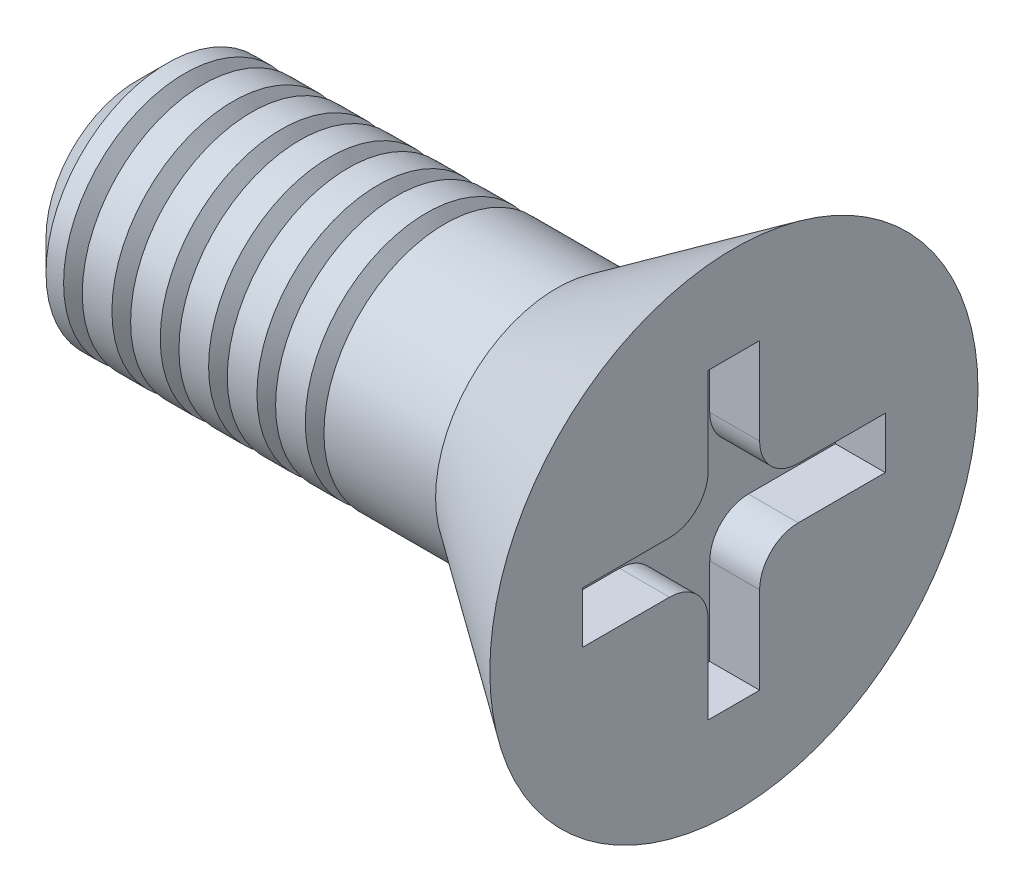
ISO-10303-21;
HEADER;
FILE_DESCRIPTION(('STEP AP214'),'2;1');
FILE_NAME('part.step','',(''),(''),'','','');
FILE_SCHEMA(('AUTOMOTIVE_DESIGN { 1 0 10303 214 1 1 1 1 }'));
ENDSEC;
DATA;
#1=APPLICATION_CONTEXT('core data for automotive mechanical design processes');
#2=APPLICATION_PROTOCOL_DEFINITION('international standard','automotive_design',2000,#1);
#3=PRODUCT_CONTEXT('',#1,'mechanical');
#4=PRODUCT('Part','Part','',(#3));
#5=PRODUCT_RELATED_PRODUCT_CATEGORY('part','',(#4));
#6=PRODUCT_DEFINITION_FORMATION('','',#4);
#7=PRODUCT_DEFINITION_CONTEXT('part definition',#1,'design');
#8=PRODUCT_DEFINITION('design','',#6,#7);
#9=PRODUCT_DEFINITION_SHAPE('','',#8);
#10=(LENGTH_UNIT() NAMED_UNIT(*) SI_UNIT(.MILLI.,.METRE.));
#11=(NAMED_UNIT(*) PLANE_ANGLE_UNIT() SI_UNIT($,.RADIAN.));
#12=(NAMED_UNIT(*) SI_UNIT($,.STERADIAN.) SOLID_ANGLE_UNIT());
#13=UNCERTAINTY_MEASURE_WITH_UNIT(LENGTH_MEASURE(1.E-05),#10,'distance_accuracy_value','');
#14=(GEOMETRIC_REPRESENTATION_CONTEXT(3) GLOBAL_UNCERTAINTY_ASSIGNED_CONTEXT((#13)) GLOBAL_UNIT_ASSIGNED_CONTEXT((#10,
#11,#12)) REPRESENTATION_CONTEXT('',''));
#15=CARTESIAN_POINT('',(0.,0.,0.));
#16=DIRECTION('',(0.,0.,1.));
#17=DIRECTION('',(1.,0.,0.));
#18=AXIS2_PLACEMENT_3D('',#15,#16,#17);
#19=CARTESIAN_POINT('',(3.175,0.,0.));
#20=DIRECTION('',(1.,0.,0.));
#21=DIRECTION('',(0.,0.,-1.));
#22=AXIS2_PLACEMENT_3D('',#19,#20,#21);
#23=CYLINDRICAL_SURFACE('',#22,1.59004000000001);
#24=CARTESIAN_POINT('',(0.84582,0.,0.));
#25=DIRECTION('',(1.,0.,0.));
#26=DIRECTION('',(0.,0.,-1.));
#27=AXIS2_PLACEMENT_3D('',#24,#25,#26);
#28=CIRCLE('',#27,1.59004000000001);
#29=CARTESIAN_POINT('',(0.84582,0.,-1.59004000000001));
#30=VERTEX_POINT('',#29);
#31=EDGE_CURVE('E230',#30,#30,#28,.T.);
#32=ORIENTED_EDGE('',*,*,#31,.F.);
#33=EDGE_LOOP('',(#32));
#34=FACE_BOUND('',#33,.T.);
#35=CARTESIAN_POINT('',(-0.620951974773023,0.,0.));
#36=DIRECTION('',(1.,0.,0.));
#37=DIRECTION('',(0.,0.,-1.));
#38=AXIS2_PLACEMENT_3D('',#35,#36,#37);
#39=CIRCLE('',#38,1.59004000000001);
#40=CARTESIAN_POINT('',(-0.620951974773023,0.,-1.59004000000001));
#41=VERTEX_POINT('',#40);
#42=EDGE_CURVE('E291',#41,#41,#39,.T.);
#43=ORIENTED_EDGE('',*,*,#42,.T.);
#44=EDGE_LOOP('',(#43));
#45=FACE_BOUND('',#44,.T.);
#46=ADVANCED_FACE('F37',(#34,#45),#23,.T.);
#47=CARTESIAN_POINT('',(3.175,0.,0.));
#48=DIRECTION('',(1.,0.,0.));
#49=DIRECTION('',(0.,0.,-1.));
#50=AXIS2_PLACEMENT_3D('',#47,#48,#49);
#51=PLANE('',#50);
#52=DIRECTION('',(0.,-1.,0.));
#53=VECTOR('',#52,1.);
#54=CARTESIAN_POINT('',(3.175,-1.98882,0.33782));
#55=LINE('',#54,#53);
#56=CARTESIAN_POINT('',(3.175,-0.845820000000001,0.33782));
#57=VERTEX_POINT('',#56);
#58=CARTESIAN_POINT('',(3.175,-1.98882,0.33782));
#59=VERTEX_POINT('',#58);
#60=EDGE_CURVE('E213',#57,#59,#55,.T.);
#61=ORIENTED_EDGE('',*,*,#60,.F.);
#62=CARTESIAN_POINT('',(3.175,-0.84582,0.845819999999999));
#63=DIRECTION('',(1.,0.,0.));
#64=DIRECTION('',(0.,0.,-1.));
#65=AXIS2_PLACEMENT_3D('',#62,#63,#64);
#66=CIRCLE('',#65,0.508);
#67=CARTESIAN_POINT('',(3.175,-0.33782,0.845819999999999));
#68=VERTEX_POINT('',#67);
#69=EDGE_CURVE('E265',#57,#68,#66,.T.);
#70=ORIENTED_EDGE('',*,*,#69,.T.);
#71=DIRECTION('',(0.,0.,-1.));
#72=VECTOR('',#71,1.);
#73=CARTESIAN_POINT('',(3.175,-0.33782,0.337819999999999));
#74=LINE('',#73,#72);
#75=CARTESIAN_POINT('',(3.175,-0.33782,1.98882));
#76=VERTEX_POINT('',#75);
#77=EDGE_CURVE('E210',#76,#68,#74,.T.);
#78=ORIENTED_EDGE('',*,*,#77,.F.);
#79=DIRECTION('',(0.,-1.,0.));
#80=VECTOR('',#79,1.);
#81=CARTESIAN_POINT('',(3.175,0.33782,1.98882));
#82=LINE('',#81,#80);
#83=CARTESIAN_POINT('',(3.175,0.33782,1.98882));
#84=VERTEX_POINT('',#83);
#85=EDGE_CURVE('E207',#84,#76,#82,.T.);
#86=ORIENTED_EDGE('',*,*,#85,.F.);
#87=DIRECTION('',(0.,0.,1.));
#88=VECTOR('',#87,1.);
#89=CARTESIAN_POINT('',(3.175,0.33782,0.33782));
#90=LINE('',#89,#88);
#91=CARTESIAN_POINT('',(3.175,0.33782,0.845819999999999));
#92=VERTEX_POINT('',#91);
#93=EDGE_CURVE('E205',#92,#84,#90,.T.);
#94=ORIENTED_EDGE('',*,*,#93,.F.);
#95=CARTESIAN_POINT('',(3.175,0.84582,0.84582));
#96=DIRECTION('',(1.,0.,0.));
#97=DIRECTION('',(0.,0.,-1.));
#98=AXIS2_PLACEMENT_3D('',#95,#96,#97);
#99=CIRCLE('',#98,0.508);
#100=CARTESIAN_POINT('',(3.175,0.84582,0.33782));
#101=VERTEX_POINT('',#100);
#102=EDGE_CURVE('E259',#92,#101,#99,.T.);
#103=ORIENTED_EDGE('',*,*,#102,.T.);
#104=DIRECTION('',(0.,-1.,0.));
#105=VECTOR('',#104,1.);
#106=CARTESIAN_POINT('',(3.175,1.98882,0.337820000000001));
#107=LINE('',#106,#105);
#108=CARTESIAN_POINT('',(3.175,1.98882,0.337820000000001));
#109=VERTEX_POINT('',#108);
#110=EDGE_CURVE('E203',#109,#101,#107,.T.);
#111=ORIENTED_EDGE('',*,*,#110,.F.);
#112=DIRECTION('',(0.,0.,1.));
#113=VECTOR('',#112,1.);
#114=CARTESIAN_POINT('',(3.175,1.98882,-0.337820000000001));
#115=LINE('',#114,#113);
#116=CARTESIAN_POINT('',(3.175,1.98882,-0.337820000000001));
#117=VERTEX_POINT('',#116);
#118=EDGE_CURVE('E158',#117,#109,#115,.T.);
#119=ORIENTED_EDGE('',*,*,#118,.F.);
#120=DIRECTION('',(0.,1.,0.));
#121=VECTOR('',#120,1.);
#122=CARTESIAN_POINT('',(3.175,1.98882,-0.337820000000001));
#123=LINE('',#122,#121);
#124=CARTESIAN_POINT('',(3.175,0.845820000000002,-0.33782));
#125=VERTEX_POINT('',#124);
#126=EDGE_CURVE('E170',#125,#117,#123,.T.);
#127=ORIENTED_EDGE('',*,*,#126,.F.);
#128=CARTESIAN_POINT('',(3.175,0.845820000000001,-0.84582));
#129=DIRECTION('',(1.,0.,0.));
#130=DIRECTION('',(0.,0.,-1.));
#131=AXIS2_PLACEMENT_3D('',#128,#129,#130);
#132=CIRCLE('',#131,0.508);
#133=CARTESIAN_POINT('',(3.175,0.337820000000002,-0.845819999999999));
#134=VERTEX_POINT('',#133);
#135=EDGE_CURVE('E261',#125,#134,#132,.T.);
#136=ORIENTED_EDGE('',*,*,#135,.T.);
#137=DIRECTION('',(0.,0.,1.));
#138=VECTOR('',#137,1.);
#139=CARTESIAN_POINT('',(3.175,0.337820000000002,-0.33782));
#140=LINE('',#139,#138);
#141=CARTESIAN_POINT('',(3.175,0.33782,-1.98882));
#142=VERTEX_POINT('',#141);
#143=EDGE_CURVE('E172',#142,#134,#140,.T.);
#144=ORIENTED_EDGE('',*,*,#143,.F.);
#145=DIRECTION('',(0.,1.,0.));
#146=VECTOR('',#145,1.);
#147=CARTESIAN_POINT('',(3.175,-0.33782,-1.98882));
#148=LINE('',#147,#146);
#149=CARTESIAN_POINT('',(3.175,-0.33782,-1.98882));
#150=VERTEX_POINT('',#149);
#151=EDGE_CURVE('E223',#150,#142,#148,.T.);
#152=ORIENTED_EDGE('',*,*,#151,.F.);
#153=DIRECTION('',(0.,0.,-1.));
#154=VECTOR('',#153,1.);
#155=CARTESIAN_POINT('',(3.175,-0.337820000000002,-0.337819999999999));
#156=LINE('',#155,#154);
#157=CARTESIAN_POINT('',(3.175,-0.337820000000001,-0.845819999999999));
#158=VERTEX_POINT('',#157);
#159=EDGE_CURVE('E221',#158,#150,#156,.T.);
#160=ORIENTED_EDGE('',*,*,#159,.F.);
#161=CARTESIAN_POINT('',(3.175,-0.845820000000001,-0.84582));
#162=DIRECTION('',(1.,0.,0.));
#163=DIRECTION('',(0.,0.,-1.));
#164=AXIS2_PLACEMENT_3D('',#161,#162,#163);
#165=CIRCLE('',#164,0.508);
#166=CARTESIAN_POINT('',(3.175,-0.845820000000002,-0.33782));
#167=VERTEX_POINT('',#166);
#168=EDGE_CURVE('E263',#158,#167,#165,.T.);
#169=ORIENTED_EDGE('',*,*,#168,.T.);
#170=DIRECTION('',(0.,1.,0.));
#171=VECTOR('',#170,1.);
#172=CARTESIAN_POINT('',(3.175,-1.98882,-0.337820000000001));
#173=LINE('',#172,#171);
#174=CARTESIAN_POINT('',(3.175,-1.98882,-0.337820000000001));
#175=VERTEX_POINT('',#174);
#176=EDGE_CURVE('E218',#175,#167,#173,.T.);
#177=ORIENTED_EDGE('',*,*,#176,.F.);
#178=DIRECTION('',(0.,0.,-1.));
#179=VECTOR('',#178,1.);
#180=CARTESIAN_POINT('',(3.175,-1.98882,0.33782));
#181=LINE('',#180,#179);
#182=EDGE_CURVE('E215',#59,#175,#181,.T.);
#183=ORIENTED_EDGE('',*,*,#182,.F.);
#184=EDGE_LOOP('',(#61,#70,#78,#86,#94,#103,#111,#119,#127,#136,#144,#152,#160,#169,#177,#183));
#185=FACE_BOUND('',#184,.T.);
#186=CARTESIAN_POINT('',(3.175,0.,0.));
#187=DIRECTION('',(1.,0.,0.));
#188=DIRECTION('',(0.,0.,-1.));
#189=AXIS2_PLACEMENT_3D('',#186,#187,#188);
#190=CIRCLE('',#189,3.20675000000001);
#191=CARTESIAN_POINT('',(3.175,0.,-3.20675000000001));
#192=VERTEX_POINT('',#191);
#193=EDGE_CURVE('E247',#192,#192,#190,.T.);
#194=ORIENTED_EDGE('',*,*,#193,.T.);
#195=EDGE_LOOP('',(#194));
#196=FACE_BOUND('',#195,.T.);
#197=ADVANCED_FACE('F371',(#185,#196),#51,.T.);
#198=CARTESIAN_POINT('',(3.175,0.,0.));
#199=DIRECTION('',(1.,0.,0.));
#200=DIRECTION('',(0.,0.,-1.));
#201=AXIS2_PLACEMENT_3D('',#198,#199,#200);
#202=CONICAL_SURFACE('',#201,3.20675000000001,0.606762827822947);
#203=ORIENTED_EDGE('',*,*,#31,.T.);
#204=EDGE_LOOP('',(#203));
#205=FACE_BOUND('',#204,.T.);
#206=ORIENTED_EDGE('',*,*,#193,.F.);
#207=EDGE_LOOP('',(#206));
#208=FACE_BOUND('',#207,.T.);
#209=ADVANCED_FACE('F377',(#205,#208),#202,.T.);
#210=CARTESIAN_POINT('',(2.51968,1.98882,-0.337820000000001));
#211=DIRECTION('',(0.,1.,0.));
#212=DIRECTION('',(0.,0.,1.));
#213=AXIS2_PLACEMENT_3D('',#210,#211,#212);
#214=PLANE('',#213);
#215=ORIENTED_EDGE('',*,*,#118,.T.);
#216=DIRECTION('',(1.,0.,0.));
#217=VECTOR('',#216,1.);
#218=CARTESIAN_POINT('',(2.51968,1.98882,0.337820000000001));
#219=LINE('',#218,#217);
#220=CARTESIAN_POINT('',(2.51968,1.98882,0.337820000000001));
#221=VERTEX_POINT('',#220);
#222=EDGE_CURVE('E152',#221,#109,#219,.T.);
#223=ORIENTED_EDGE('',*,*,#222,.F.);
#224=DIRECTION('',(0.,0.,1.));
#225=VECTOR('',#224,1.);
#226=CARTESIAN_POINT('',(2.51968,1.98882,-0.337820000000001));
#227=LINE('',#226,#225);
#228=CARTESIAN_POINT('',(2.51968,1.98882,-0.337820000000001));
#229=VERTEX_POINT('',#228);
#230=EDGE_CURVE('E156',#229,#221,#227,.T.);
#231=ORIENTED_EDGE('',*,*,#230,.F.);
#232=DIRECTION('',(1.,0.,0.));
#233=VECTOR('',#232,1.);
#234=CARTESIAN_POINT('',(2.51968,1.98882,-0.337820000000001));
#235=LINE('',#234,#233);
#236=EDGE_CURVE('E228',#229,#117,#235,.T.);
#237=ORIENTED_EDGE('',*,*,#236,.T.);
#238=EDGE_LOOP('',(#215,#223,#231,#237));
#239=FACE_BOUND('',#238,.T.);
#240=ADVANCED_FACE('F153',(#239),#214,.F.);
#241=CARTESIAN_POINT('',(2.51968,1.98882,-0.337820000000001));
#242=DIRECTION('',(0.,0.,-1.));
#243=DIRECTION('',(0.,1.,0.));
#244=AXIS2_PLACEMENT_3D('',#241,#242,#243);
#245=PLANE('',#244);
#246=DIRECTION('',(0.,1.,0.));
#247=VECTOR('',#246,1.);
#248=CARTESIAN_POINT('',(2.51968,1.98882,-0.337820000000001));
#249=LINE('',#248,#247);
#250=CARTESIAN_POINT('',(2.51968,0.845820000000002,-0.33782));
#251=VERTEX_POINT('',#250);
#252=EDGE_CURVE('E161',#251,#229,#249,.T.);
#253=ORIENTED_EDGE('',*,*,#252,.F.);
#254=DIRECTION('',(1.,0.,0.));
#255=VECTOR('',#254,1.);
#256=CARTESIAN_POINT('',(2.51968,0.845820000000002,-0.33782));
#257=LINE('',#256,#255);
#258=EDGE_CURVE('E274',#251,#125,#257,.T.);
#259=ORIENTED_EDGE('',*,*,#258,.T.);
#260=ORIENTED_EDGE('',*,*,#126,.T.);
#261=ORIENTED_EDGE('',*,*,#236,.F.);
#262=EDGE_LOOP('',(#253,#259,#260,#261));
#263=FACE_BOUND('',#262,.T.);
#264=ADVANCED_FACE('F471',(#263),#245,.F.);
#265=CARTESIAN_POINT('',(2.51968,0.337820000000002,-0.33782));
#266=DIRECTION('',(0.,1.,0.));
#267=DIRECTION('',(0.,0.,1.));
#268=AXIS2_PLACEMENT_3D('',#265,#266,#267);
#269=PLANE('',#268);
#270=ORIENTED_EDGE('',*,*,#143,.T.);
#271=DIRECTION('',(1.,0.,0.));
#272=VECTOR('',#271,1.);
#273=CARTESIAN_POINT('',(2.51968,0.337820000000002,-0.845819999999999));
#274=LINE('',#273,#272);
#275=CARTESIAN_POINT('',(2.51968,0.337820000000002,-0.845819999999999));
#276=VERTEX_POINT('',#275);
#277=EDGE_CURVE('E277',#134,#276,#274,.F.);
#278=ORIENTED_EDGE('',*,*,#277,.T.);
#279=DIRECTION('',(0.,0.,1.));
#280=VECTOR('',#279,1.);
#281=CARTESIAN_POINT('',(2.51968,0.337820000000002,-0.33782));
#282=LINE('',#281,#280);
#283=CARTESIAN_POINT('',(2.51968,0.33782,-1.98882));
#284=VERTEX_POINT('',#283);
#285=EDGE_CURVE('E198',#284,#276,#282,.T.);
#286=ORIENTED_EDGE('',*,*,#285,.F.);
#287=DIRECTION('',(1.,0.,0.));
#288=VECTOR('',#287,1.);
#289=CARTESIAN_POINT('',(2.51968,0.33782,-1.98882));
#290=LINE('',#289,#288);
#291=EDGE_CURVE('E231',#284,#142,#290,.T.);
#292=ORIENTED_EDGE('',*,*,#291,.T.);
#293=EDGE_LOOP('',(#270,#278,#286,#292));
#294=FACE_BOUND('',#293,.T.);
#295=ADVANCED_FACE('F505',(#294),#269,.F.);
#296=CARTESIAN_POINT('',(2.51968,-0.33782,-1.98882));
#297=DIRECTION('',(0.,0.,-1.));
#298=DIRECTION('',(-1.,0.,0.));
#299=AXIS2_PLACEMENT_3D('',#296,#297,#298);
#300=PLANE('',#299);
#301=ORIENTED_EDGE('',*,*,#151,.T.);
#302=ORIENTED_EDGE('',*,*,#291,.F.);
#303=DIRECTION('',(0.,1.,0.));
#304=VECTOR('',#303,1.);
#305=CARTESIAN_POINT('',(2.51968,-0.33782,-1.98882));
#306=LINE('',#305,#304);
#307=CARTESIAN_POINT('',(2.51968,-0.33782,-1.98882));
#308=VERTEX_POINT('',#307);
#309=EDGE_CURVE('E195',#308,#284,#306,.T.);
#310=ORIENTED_EDGE('',*,*,#309,.F.);
#311=DIRECTION('',(1.,0.,0.));
#312=VECTOR('',#311,1.);
#313=CARTESIAN_POINT('',(2.51968,-0.33782,-1.98882));
#314=LINE('',#313,#312);
#315=EDGE_CURVE('E233',#308,#150,#314,.T.);
#316=ORIENTED_EDGE('',*,*,#315,.T.);
#317=EDGE_LOOP('',(#301,#302,#310,#316));
#318=FACE_BOUND('',#317,.T.);
#319=ADVANCED_FACE('F501',(#318),#300,.F.);
#320=CARTESIAN_POINT('',(2.51968,-0.337820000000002,-0.337819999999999));
#321=DIRECTION('',(0.,-1.,0.));
#322=DIRECTION('',(0.,0.,-1.));
#323=AXIS2_PLACEMENT_3D('',#320,#321,#322);
#324=PLANE('',#323);
#325=DIRECTION('',(0.,0.,-1.));
#326=VECTOR('',#325,1.);
#327=CARTESIAN_POINT('',(2.51968,-0.337820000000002,-0.337819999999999));
#328=LINE('',#327,#326);
#329=CARTESIAN_POINT('',(2.51968,-0.337820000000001,-0.845819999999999));
#330=VERTEX_POINT('',#329);
#331=EDGE_CURVE('E193',#330,#308,#328,.T.);
#332=ORIENTED_EDGE('',*,*,#331,.F.);
#333=DIRECTION('',(1.,0.,0.));
#334=VECTOR('',#333,1.);
#335=CARTESIAN_POINT('',(2.51968,-0.337820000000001,-0.845819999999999));
#336=LINE('',#335,#334);
#337=EDGE_CURVE('E269',#330,#158,#336,.T.);
#338=ORIENTED_EDGE('',*,*,#337,.T.);
#339=ORIENTED_EDGE('',*,*,#159,.T.);
#340=ORIENTED_EDGE('',*,*,#315,.F.);
#341=EDGE_LOOP('',(#332,#338,#339,#340));
#342=FACE_BOUND('',#341,.T.);
#343=ADVANCED_FACE('F497',(#342),#324,.F.);
#344=CARTESIAN_POINT('',(2.51968,-1.98882,-0.337820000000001));
#345=DIRECTION('',(0.,0.,-1.));
#346=DIRECTION('',(0.,1.,0.));
#347=AXIS2_PLACEMENT_3D('',#344,#345,#346);
#348=PLANE('',#347);
#349=ORIENTED_EDGE('',*,*,#176,.T.);
#350=DIRECTION('',(1.,0.,0.));
#351=VECTOR('',#350,1.);
#352=CARTESIAN_POINT('',(2.51968,-0.845820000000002,-0.33782));
#353=LINE('',#352,#351);
#354=CARTESIAN_POINT('',(2.51968,-0.845820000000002,-0.33782));
#355=VERTEX_POINT('',#354);
#356=EDGE_CURVE('E272',#167,#355,#353,.F.);
#357=ORIENTED_EDGE('',*,*,#356,.T.);
#358=DIRECTION('',(0.,1.,0.));
#359=VECTOR('',#358,1.);
#360=CARTESIAN_POINT('',(2.51968,-1.98882,-0.337820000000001));
#361=LINE('',#360,#359);
#362=CARTESIAN_POINT('',(2.51968,-1.98882,-0.337820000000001));
#363=VERTEX_POINT('',#362);
#364=EDGE_CURVE('E190',#363,#355,#361,.T.);
#365=ORIENTED_EDGE('',*,*,#364,.F.);
#366=DIRECTION('',(1.,0.,0.));
#367=VECTOR('',#366,1.);
#368=CARTESIAN_POINT('',(2.51968,-1.98882,-0.337820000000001));
#369=LINE('',#368,#367);
#370=EDGE_CURVE('E236',#363,#175,#369,.T.);
#371=ORIENTED_EDGE('',*,*,#370,.T.);
#372=EDGE_LOOP('',(#349,#357,#365,#371));
#373=FACE_BOUND('',#372,.T.);
#374=ADVANCED_FACE('F493',(#373),#348,.F.);
#375=CARTESIAN_POINT('',(2.51968,-1.98882,0.33782));
#376=DIRECTION('',(0.,-1.,0.));
#377=DIRECTION('',(0.,0.,-1.));
#378=AXIS2_PLACEMENT_3D('',#375,#376,#377);
#379=PLANE('',#378);
#380=ORIENTED_EDGE('',*,*,#182,.T.);
#381=ORIENTED_EDGE('',*,*,#370,.F.);
#382=DIRECTION('',(0.,0.,-1.));
#383=VECTOR('',#382,1.);
#384=CARTESIAN_POINT('',(2.51968,-1.98882,0.33782));
#385=LINE('',#384,#383);
#386=CARTESIAN_POINT('',(2.51968,-1.98882,0.33782));
#387=VERTEX_POINT('',#386);
#388=EDGE_CURVE('E187',#387,#363,#385,.T.);
#389=ORIENTED_EDGE('',*,*,#388,.F.);
#390=DIRECTION('',(1.,0.,0.));
#391=VECTOR('',#390,1.);
#392=CARTESIAN_POINT('',(2.51968,-1.98882,0.33782));
#393=LINE('',#392,#391);
#394=EDGE_CURVE('E238',#387,#59,#393,.T.);
#395=ORIENTED_EDGE('',*,*,#394,.T.);
#396=EDGE_LOOP('',(#380,#381,#389,#395));
#397=FACE_BOUND('',#396,.T.);
#398=ADVANCED_FACE('F489',(#397),#379,.F.);
#399=CARTESIAN_POINT('',(2.51968,-1.98882,0.33782));
#400=DIRECTION('',(0.,0.,1.));
#401=DIRECTION('',(0.,-1.,0.));
#402=AXIS2_PLACEMENT_3D('',#399,#400,#401);
#403=PLANE('',#402);
#404=DIRECTION('',(0.,-1.,0.));
#405=VECTOR('',#404,1.);
#406=CARTESIAN_POINT('',(2.51968,-1.98882,0.33782));
#407=LINE('',#406,#405);
#408=CARTESIAN_POINT('',(2.51968,-0.845820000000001,0.33782));
#409=VERTEX_POINT('',#408);
#410=EDGE_CURVE('E185',#409,#387,#407,.T.);
#411=ORIENTED_EDGE('',*,*,#410,.F.);
#412=DIRECTION('',(1.,0.,0.));
#413=VECTOR('',#412,1.);
#414=CARTESIAN_POINT('',(2.51968,-0.845820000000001,0.33782));
#415=LINE('',#414,#413);
#416=EDGE_CURVE('E256',#409,#57,#415,.T.);
#417=ORIENTED_EDGE('',*,*,#416,.T.);
#418=ORIENTED_EDGE('',*,*,#60,.T.);
#419=ORIENTED_EDGE('',*,*,#394,.F.);
#420=EDGE_LOOP('',(#411,#417,#418,#419));
#421=FACE_BOUND('',#420,.T.);
#422=ADVANCED_FACE('F485',(#421),#403,.F.);
#423=CARTESIAN_POINT('',(2.51968,-0.33782,0.337819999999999));
#424=DIRECTION('',(0.,-1.,0.));
#425=DIRECTION('',(0.,0.,-1.));
#426=AXIS2_PLACEMENT_3D('',#423,#424,#425);
#427=PLANE('',#426);
#428=ORIENTED_EDGE('',*,*,#77,.T.);
#429=DIRECTION('',(1.,0.,0.));
#430=VECTOR('',#429,1.);
#431=CARTESIAN_POINT('',(2.51968,-0.33782,0.845819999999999));
#432=LINE('',#431,#430);
#433=CARTESIAN_POINT('',(2.51968,-0.33782,0.845819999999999));
#434=VERTEX_POINT('',#433);
#435=EDGE_CURVE('E267',#68,#434,#432,.F.);
#436=ORIENTED_EDGE('',*,*,#435,.T.);
#437=DIRECTION('',(0.,0.,-1.));
#438=VECTOR('',#437,1.);
#439=CARTESIAN_POINT('',(2.51968,-0.33782,0.337819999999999));
#440=LINE('',#439,#438);
#441=CARTESIAN_POINT('',(2.51968,-0.33782,1.98882));
#442=VERTEX_POINT('',#441);
#443=EDGE_CURVE('E182',#442,#434,#440,.T.);
#444=ORIENTED_EDGE('',*,*,#443,.F.);
#445=DIRECTION('',(1.,0.,0.));
#446=VECTOR('',#445,1.);
#447=CARTESIAN_POINT('',(2.51968,-0.33782,1.98882));
#448=LINE('',#447,#446);
#449=EDGE_CURVE('E241',#442,#76,#448,.T.);
#450=ORIENTED_EDGE('',*,*,#449,.T.);
#451=EDGE_LOOP('',(#428,#436,#444,#450));
#452=FACE_BOUND('',#451,.T.);
#453=ADVANCED_FACE('F481',(#452),#427,.F.);
#454=CARTESIAN_POINT('',(2.51968,0.33782,1.98882));
#455=DIRECTION('',(0.,0.,1.));
#456=DIRECTION('',(1.,0.,0.));
#457=AXIS2_PLACEMENT_3D('',#454,#455,#456);
#458=PLANE('',#457);
#459=ORIENTED_EDGE('',*,*,#85,.T.);
#460=ORIENTED_EDGE('',*,*,#449,.F.);
#461=DIRECTION('',(0.,-1.,0.));
#462=VECTOR('',#461,1.);
#463=CARTESIAN_POINT('',(2.51968,0.33782,1.98882));
#464=LINE('',#463,#462);
#465=CARTESIAN_POINT('',(2.51968,0.33782,1.98882));
#466=VERTEX_POINT('',#465);
#467=EDGE_CURVE('E179',#466,#442,#464,.T.);
#468=ORIENTED_EDGE('',*,*,#467,.F.);
#469=DIRECTION('',(1.,0.,0.));
#470=VECTOR('',#469,1.);
#471=CARTESIAN_POINT('',(2.51968,0.33782,1.98882));
#472=LINE('',#471,#470);
#473=EDGE_CURVE('E160',#466,#84,#472,.T.);
#474=ORIENTED_EDGE('',*,*,#473,.T.);
#475=EDGE_LOOP('',(#459,#460,#468,#474));
#476=FACE_BOUND('',#475,.T.);
#477=ADVANCED_FACE('F477',(#476),#458,.F.);
#478=CARTESIAN_POINT('',(2.51968,0.33782,0.33782));
#479=DIRECTION('',(0.,1.,0.));
#480=DIRECTION('',(0.,0.,1.));
#481=AXIS2_PLACEMENT_3D('',#478,#479,#480);
#482=PLANE('',#481);
#483=DIRECTION('',(0.,0.,1.));
#484=VECTOR('',#483,1.);
#485=CARTESIAN_POINT('',(2.51968,0.33782,0.33782));
#486=LINE('',#485,#484);
#487=CARTESIAN_POINT('',(2.51968,0.33782,0.845819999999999));
#488=VERTEX_POINT('',#487);
#489=EDGE_CURVE('E165',#488,#466,#486,.T.);
#490=ORIENTED_EDGE('',*,*,#489,.F.);
#491=DIRECTION('',(1.,0.,0.));
#492=VECTOR('',#491,1.);
#493=CARTESIAN_POINT('',(2.51968,0.33782,0.845819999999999));
#494=LINE('',#493,#492);
#495=EDGE_CURVE('E279',#488,#92,#494,.T.);
#496=ORIENTED_EDGE('',*,*,#495,.T.);
#497=ORIENTED_EDGE('',*,*,#93,.T.);
#498=ORIENTED_EDGE('',*,*,#473,.F.);
#499=EDGE_LOOP('',(#490,#496,#497,#498));
#500=FACE_BOUND('',#499,.T.);
#501=ADVANCED_FACE('F474',(#500),#482,.F.);
#502=CARTESIAN_POINT('',(2.51968,1.98882,0.337820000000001));
#503=DIRECTION('',(0.,0.,1.));
#504=DIRECTION('',(0.,-1.,0.));
#505=AXIS2_PLACEMENT_3D('',#502,#503,#504);
#506=PLANE('',#505);
#507=ORIENTED_EDGE('',*,*,#110,.T.);
#508=DIRECTION('',(1.,0.,0.));
#509=VECTOR('',#508,1.);
#510=CARTESIAN_POINT('',(2.51968,0.84582,0.33782));
#511=LINE('',#510,#509);
#512=CARTESIAN_POINT('',(2.51968,0.84582,0.33782));
#513=VERTEX_POINT('',#512);
#514=EDGE_CURVE('E54',#101,#513,#511,.F.);
#515=ORIENTED_EDGE('',*,*,#514,.T.);
#516=DIRECTION('',(0.,-1.,0.));
#517=VECTOR('',#516,1.);
#518=CARTESIAN_POINT('',(2.51968,1.98882,0.337820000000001));
#519=LINE('',#518,#517);
#520=EDGE_CURVE('E163',#221,#513,#519,.T.);
#521=ORIENTED_EDGE('',*,*,#520,.F.);
#522=ORIENTED_EDGE('',*,*,#222,.T.);
#523=EDGE_LOOP('',(#507,#515,#521,#522));
#524=FACE_BOUND('',#523,.T.);
#525=ADVANCED_FACE('F164',(#524),#506,.F.);
#526=CARTESIAN_POINT('',(2.51968,0.,0.));
#527=DIRECTION('',(1.,0.,0.));
#528=DIRECTION('',(0.,0.,-1.));
#529=AXIS2_PLACEMENT_3D('',#526,#527,#528);
#530=PLANE('',#529);
#531=ORIENTED_EDGE('',*,*,#230,.T.);
#532=ORIENTED_EDGE('',*,*,#520,.T.);
#533=CARTESIAN_POINT('',(2.51968,0.84582,0.84582));
#534=DIRECTION('',(1.,0.,0.));
#535=DIRECTION('',(0.,0.,-1.));
#536=AXIS2_PLACEMENT_3D('',#533,#534,#535);
#537=CIRCLE('',#536,0.508);
#538=EDGE_CURVE('E11',#513,#488,#537,.F.);
#539=ORIENTED_EDGE('',*,*,#538,.T.);
#540=ORIENTED_EDGE('',*,*,#489,.T.);
#541=ORIENTED_EDGE('',*,*,#467,.T.);
#542=ORIENTED_EDGE('',*,*,#443,.T.);
#543=CARTESIAN_POINT('',(2.51968,-0.84582,0.845819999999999));
#544=DIRECTION('',(1.,0.,0.));
#545=DIRECTION('',(0.,0.,-1.));
#546=AXIS2_PLACEMENT_3D('',#543,#544,#545);
#547=CIRCLE('',#546,0.508);
#548=EDGE_CURVE('E283',#434,#409,#547,.F.);
#549=ORIENTED_EDGE('',*,*,#548,.T.);
#550=ORIENTED_EDGE('',*,*,#410,.T.);
#551=ORIENTED_EDGE('',*,*,#388,.T.);
#552=ORIENTED_EDGE('',*,*,#364,.T.);
#553=CARTESIAN_POINT('',(2.51968,-0.845820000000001,-0.84582));
#554=DIRECTION('',(1.,0.,0.));
#555=DIRECTION('',(0.,0.,-1.));
#556=AXIS2_PLACEMENT_3D('',#553,#554,#555);
#557=CIRCLE('',#556,0.508);
#558=EDGE_CURVE('E285',#355,#330,#557,.F.);
#559=ORIENTED_EDGE('',*,*,#558,.T.);
#560=ORIENTED_EDGE('',*,*,#331,.T.);
#561=ORIENTED_EDGE('',*,*,#309,.T.);
#562=ORIENTED_EDGE('',*,*,#285,.T.);
#563=CARTESIAN_POINT('',(2.51968,0.845820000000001,-0.84582));
#564=DIRECTION('',(1.,0.,0.));
#565=DIRECTION('',(0.,0.,-1.));
#566=AXIS2_PLACEMENT_3D('',#563,#564,#565);
#567=CIRCLE('',#566,0.508);
#568=EDGE_CURVE('E46',#276,#251,#567,.F.);
#569=ORIENTED_EDGE('',*,*,#568,.T.);
#570=ORIENTED_EDGE('',*,*,#252,.T.);
#571=EDGE_LOOP('',(#531,#532,#539,#540,#541,#542,#549,#550,#551,#552,#559,#560,#561,#562,#569,#570));
#572=FACE_BOUND('',#571,.T.);
#573=ADVANCED_FACE('F167',(#572),#530,.T.);
#574=CARTESIAN_POINT('',(2.51968,-0.84582,0.845819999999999));
#575=DIRECTION('',(1.,0.,0.));
#576=DIRECTION('',(0.,0.,-1.));
#577=AXIS2_PLACEMENT_3D('',#574,#575,#576);
#578=CYLINDRICAL_SURFACE('',#577,0.508);
#579=ORIENTED_EDGE('',*,*,#548,.F.);
#580=ORIENTED_EDGE('',*,*,#435,.F.);
#581=ORIENTED_EDGE('',*,*,#69,.F.);
#582=ORIENTED_EDGE('',*,*,#416,.F.);
#583=EDGE_LOOP('',(#579,#580,#581,#582));
#584=FACE_BOUND('',#583,.T.);
#585=ADVANCED_FACE('F513',(#584),#578,.T.);
#586=CARTESIAN_POINT('',(2.51968,-0.845820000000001,-0.84582));
#587=DIRECTION('',(1.,0.,0.));
#588=DIRECTION('',(0.,0.,-1.));
#589=AXIS2_PLACEMENT_3D('',#586,#587,#588);
#590=CYLINDRICAL_SURFACE('',#589,0.508);
#591=ORIENTED_EDGE('',*,*,#558,.F.);
#592=ORIENTED_EDGE('',*,*,#356,.F.);
#593=ORIENTED_EDGE('',*,*,#168,.F.);
#594=ORIENTED_EDGE('',*,*,#337,.F.);
#595=EDGE_LOOP('',(#591,#592,#593,#594));
#596=FACE_BOUND('',#595,.T.);
#597=ADVANCED_FACE('F518',(#596),#590,.T.);
#598=CARTESIAN_POINT('',(2.51968,0.845820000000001,-0.84582));
#599=DIRECTION('',(1.,0.,0.));
#600=DIRECTION('',(0.,0.,-1.));
#601=AXIS2_PLACEMENT_3D('',#598,#599,#600);
#602=CYLINDRICAL_SURFACE('',#601,0.508);
#603=ORIENTED_EDGE('',*,*,#568,.F.);
#604=ORIENTED_EDGE('',*,*,#277,.F.);
#605=ORIENTED_EDGE('',*,*,#135,.F.);
#606=ORIENTED_EDGE('',*,*,#258,.F.);
#607=EDGE_LOOP('',(#603,#604,#605,#606));
#608=FACE_BOUND('',#607,.T.);
#609=ADVANCED_FACE('F366',(#608),#602,.T.);
#610=CARTESIAN_POINT('',(2.51968,0.84582,0.84582));
#611=DIRECTION('',(1.,0.,0.));
#612=DIRECTION('',(0.,0.,-1.));
#613=AXIS2_PLACEMENT_3D('',#610,#611,#612);
#614=CYLINDRICAL_SURFACE('',#613,0.508);
#615=ORIENTED_EDGE('',*,*,#538,.F.);
#616=ORIENTED_EDGE('',*,*,#514,.F.);
#617=ORIENTED_EDGE('',*,*,#102,.F.);
#618=ORIENTED_EDGE('',*,*,#495,.F.);
#619=EDGE_LOOP('',(#615,#616,#617,#618));
#620=FACE_BOUND('',#619,.T.);
#621=ADVANCED_FACE('F39',(#620),#614,.T.);
#622=CARTESIAN_POINT('',(-0.742479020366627,0.,0.));
#623=DIRECTION('',(1.,0.,0.));
#624=DIRECTION('',(0.,0.,-1.));
#625=AXIS2_PLACEMENT_3D('',#622,#623,#624);
#626=CONICAL_SURFACE('',#625,1.39265805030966,1.01891637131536);
#627=ORIENTED_EDGE('',*,*,#42,.F.);
#628=EDGE_LOOP('',(#627));
#629=FACE_BOUND('',#628,.T.);
#630=CARTESIAN_POINT('',(-0.742479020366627,0.,0.));
#631=DIRECTION('',(-1.,0.,0.));
#632=DIRECTION('',(0.,0.,1.));
#633=AXIS2_PLACEMENT_3D('',#630,#631,#632);
#634=CIRCLE('',#633,1.39265805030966);
#635=CARTESIAN_POINT('',(-0.742479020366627,0.,1.39265805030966));
#636=VERTEX_POINT('',#635);
#637=EDGE_CURVE('E175',#636,#636,#634,.T.);
#638=ORIENTED_EDGE('',*,*,#637,.F.);
#639=EDGE_LOOP('',(#638));
#640=FACE_BOUND('',#639,.T.);
#641=ADVANCED_FACE('F354',(#629,#640),#626,.T.);
#642=CARTESIAN_POINT('',(-1.02477458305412,0.,0.));
#643=DIRECTION('',(-1.,0.,0.));
#644=DIRECTION('',(0.,0.,1.));
#645=AXIS2_PLACEMENT_3D('',#642,#643,#644);
#646=CONICAL_SURFACE('',#645,1.84282252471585,1.01069243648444);
#647=CARTESIAN_POINT('',(-0.866256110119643,0.,0.));
#648=DIRECTION('',(-1.,0.,0.));
#649=DIRECTION('',(0.,0.,1.));
#650=AXIS2_PLACEMENT_3D('',#647,#648,#649);
#651=CIRCLE('',#650,1.59004000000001);
#652=CARTESIAN_POINT('',(-0.866256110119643,0.,1.59004000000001));
#653=VERTEX_POINT('',#652);
#654=EDGE_CURVE('E288',#653,#653,#651,.T.);
#655=ORIENTED_EDGE('',*,*,#654,.F.);
#656=EDGE_LOOP('',(#655));
#657=FACE_BOUND('',#656,.T.);
#658=ORIENTED_EDGE('',*,*,#637,.T.);
#659=EDGE_LOOP('',(#658));
#660=FACE_BOUND('',#659,.T.);
#661=ADVANCED_FACE('F352',(#657,#660),#646,.T.);
#662=ORIENTED_EDGE('',*,*,#654,.T.);
#663=EDGE_LOOP('',(#662));
#664=FACE_BOUND('',#663,.T.);
#665=CARTESIAN_POINT('',(-1.25595197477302,0.,0.));
#666=DIRECTION('',(1.,0.,0.));
#667=DIRECTION('',(0.,0.,-1.));
#668=AXIS2_PLACEMENT_3D('',#665,#666,#667);
#669=CIRCLE('',#668,1.59004000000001);
#670=CARTESIAN_POINT('',(-1.25595197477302,0.,-1.59004000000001));
#671=VERTEX_POINT('',#670);
#672=EDGE_CURVE('E298',#671,#671,#669,.T.);
#673=ORIENTED_EDGE('',*,*,#672,.T.);
#674=EDGE_LOOP('',(#673));
#675=FACE_BOUND('',#674,.T.);
#676=ADVANCED_FACE('F362',(#664,#675),#23,.T.);
#677=CARTESIAN_POINT('',(-1.37747902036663,0.,0.));
#678=DIRECTION('',(1.,0.,0.));
#679=DIRECTION('',(0.,0.,-1.));
#680=AXIS2_PLACEMENT_3D('',#677,#678,#679);
#681=CONICAL_SURFACE('',#680,1.39265805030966,1.01891637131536);
#682=ORIENTED_EDGE('',*,*,#672,.F.);
#683=EDGE_LOOP('',(#682));
#684=FACE_BOUND('',#683,.T.);
#685=CARTESIAN_POINT('',(-1.37747902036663,0.,0.));
#686=DIRECTION('',(-1.,0.,0.));
#687=DIRECTION('',(0.,0.,1.));
#688=AXIS2_PLACEMENT_3D('',#685,#686,#687);
#689=CIRCLE('',#688,1.39265805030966);
#690=CARTESIAN_POINT('',(-1.37747902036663,0.,1.39265805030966));
#691=VERTEX_POINT('',#690);
#692=EDGE_CURVE('E345',#691,#691,#689,.T.);
#693=ORIENTED_EDGE('',*,*,#692,.F.);
#694=EDGE_LOOP('',(#693));
#695=FACE_BOUND('',#694,.T.);
#696=ADVANCED_FACE('F389',(#684,#695),#681,.T.);
#697=CARTESIAN_POINT('',(-1.65977458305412,0.,0.));
#698=DIRECTION('',(-1.,0.,0.));
#699=DIRECTION('',(0.,0.,1.));
#700=AXIS2_PLACEMENT_3D('',#697,#698,#699);
#701=CONICAL_SURFACE('',#700,1.84282252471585,1.01069243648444);
#702=CARTESIAN_POINT('',(-1.50125611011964,0.,0.));
#703=DIRECTION('',(-1.,0.,0.));
#704=DIRECTION('',(0.,0.,1.));
#705=AXIS2_PLACEMENT_3D('',#702,#703,#704);
#706=CIRCLE('',#705,1.59004000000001);
#707=CARTESIAN_POINT('',(-1.50125611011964,0.,1.59004000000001));
#708=VERTEX_POINT('',#707);
#709=EDGE_CURVE('E295',#708,#708,#706,.T.);
#710=ORIENTED_EDGE('',*,*,#709,.F.);
#711=EDGE_LOOP('',(#710));
#712=FACE_BOUND('',#711,.T.);
#713=ORIENTED_EDGE('',*,*,#692,.T.);
#714=EDGE_LOOP('',(#713));
#715=FACE_BOUND('',#714,.T.);
#716=ADVANCED_FACE('F397',(#712,#715),#701,.T.);
#717=ORIENTED_EDGE('',*,*,#709,.T.);
#718=EDGE_LOOP('',(#717));
#719=FACE_BOUND('',#718,.T.);
#720=CARTESIAN_POINT('',(-1.89095197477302,0.,0.));
#721=DIRECTION('',(1.,0.,0.));
#722=DIRECTION('',(0.,0.,-1.));
#723=AXIS2_PLACEMENT_3D('',#720,#721,#722);
#724=CIRCLE('',#723,1.59004000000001);
#725=CARTESIAN_POINT('',(-1.89095197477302,0.,-1.59004000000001));
#726=VERTEX_POINT('',#725);
#727=EDGE_CURVE('E304',#726,#726,#724,.T.);
#728=ORIENTED_EDGE('',*,*,#727,.T.);
#729=EDGE_LOOP('',(#728));
#730=FACE_BOUND('',#729,.T.);
#731=ADVANCED_FACE('F391',(#719,#730),#23,.T.);
#732=CARTESIAN_POINT('',(-2.01247902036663,0.,0.));
#733=DIRECTION('',(1.,0.,0.));
#734=DIRECTION('',(0.,0.,-1.));
#735=AXIS2_PLACEMENT_3D('',#732,#733,#734);
#736=CONICAL_SURFACE('',#735,1.39265805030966,1.01891637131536);
#737=ORIENTED_EDGE('',*,*,#727,.F.);
#738=EDGE_LOOP('',(#737));
#739=FACE_BOUND('',#738,.T.);
#740=CARTESIAN_POINT('',(-2.01247902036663,0.,0.));
#741=DIRECTION('',(-1.,0.,0.));
#742=DIRECTION('',(0.,0.,1.));
#743=AXIS2_PLACEMENT_3D('',#740,#741,#742);
#744=CIRCLE('',#743,1.39265805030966);
#745=CARTESIAN_POINT('',(-2.01247902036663,0.,1.39265805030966));
#746=VERTEX_POINT('',#745);
#747=EDGE_CURVE('E343',#746,#746,#744,.T.);
#748=ORIENTED_EDGE('',*,*,#747,.F.);
#749=EDGE_LOOP('',(#748));
#750=FACE_BOUND('',#749,.T.);
#751=ADVANCED_FACE('F402',(#739,#750),#736,.T.);
#752=CARTESIAN_POINT('',(-2.29477458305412,0.,0.));
#753=DIRECTION('',(-1.,0.,0.));
#754=DIRECTION('',(0.,0.,1.));
#755=AXIS2_PLACEMENT_3D('',#752,#753,#754);
#756=CONICAL_SURFACE('',#755,1.84282252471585,1.01069243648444);
#757=CARTESIAN_POINT('',(-2.13625611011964,0.,0.));
#758=DIRECTION('',(-1.,0.,0.));
#759=DIRECTION('',(0.,0.,1.));
#760=AXIS2_PLACEMENT_3D('',#757,#758,#759);
#761=CIRCLE('',#760,1.59004000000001);
#762=CARTESIAN_POINT('',(-2.13625611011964,0.,1.59004000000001));
#763=VERTEX_POINT('',#762);
#764=EDGE_CURVE('E301',#763,#763,#761,.T.);
#765=ORIENTED_EDGE('',*,*,#764,.F.);
#766=EDGE_LOOP('',(#765));
#767=FACE_BOUND('',#766,.T.);
#768=ORIENTED_EDGE('',*,*,#747,.T.);
#769=EDGE_LOOP('',(#768));
#770=FACE_BOUND('',#769,.T.);
#771=ADVANCED_FACE('F410',(#767,#770),#756,.T.);
#772=ORIENTED_EDGE('',*,*,#764,.T.);
#773=EDGE_LOOP('',(#772));
#774=FACE_BOUND('',#773,.T.);
#775=CARTESIAN_POINT('',(-2.52595197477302,0.,0.));
#776=DIRECTION('',(1.,0.,0.));
#777=DIRECTION('',(0.,0.,-1.));
#778=AXIS2_PLACEMENT_3D('',#775,#776,#777);
#779=CIRCLE('',#778,1.59004000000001);
#780=CARTESIAN_POINT('',(-2.52595197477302,0.,-1.59004000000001));
#781=VERTEX_POINT('',#780);
#782=EDGE_CURVE('E310',#781,#781,#779,.T.);
#783=ORIENTED_EDGE('',*,*,#782,.T.);
#784=EDGE_LOOP('',(#783));
#785=FACE_BOUND('',#784,.T.);
#786=ADVANCED_FACE('F404',(#774,#785),#23,.T.);
#787=CARTESIAN_POINT('',(-2.64747902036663,0.,0.));
#788=DIRECTION('',(1.,0.,0.));
#789=DIRECTION('',(0.,0.,-1.));
#790=AXIS2_PLACEMENT_3D('',#787,#788,#789);
#791=CONICAL_SURFACE('',#790,1.39265805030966,1.01891637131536);
#792=ORIENTED_EDGE('',*,*,#782,.F.);
#793=EDGE_LOOP('',(#792));
#794=FACE_BOUND('',#793,.T.);
#795=CARTESIAN_POINT('',(-2.64747902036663,0.,0.));
#796=DIRECTION('',(-1.,0.,0.));
#797=DIRECTION('',(0.,0.,1.));
#798=AXIS2_PLACEMENT_3D('',#795,#796,#797);
#799=CIRCLE('',#798,1.39265805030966);
#800=CARTESIAN_POINT('',(-2.64747902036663,0.,1.39265805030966));
#801=VERTEX_POINT('',#800);
#802=EDGE_CURVE('E338',#801,#801,#799,.T.);
#803=ORIENTED_EDGE('',*,*,#802,.F.);
#804=EDGE_LOOP('',(#803));
#805=FACE_BOUND('',#804,.T.);
#806=ADVANCED_FACE('F418',(#794,#805),#791,.T.);
#807=CARTESIAN_POINT('',(-2.92977458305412,0.,0.));
#808=DIRECTION('',(-1.,0.,0.));
#809=DIRECTION('',(0.,0.,1.));
#810=AXIS2_PLACEMENT_3D('',#807,#808,#809);
#811=CONICAL_SURFACE('',#810,1.84282252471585,1.01069243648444);
#812=CARTESIAN_POINT('',(-2.77125611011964,0.,0.));
#813=DIRECTION('',(-1.,0.,0.));
#814=DIRECTION('',(0.,0.,1.));
#815=AXIS2_PLACEMENT_3D('',#812,#813,#814);
#816=CIRCLE('',#815,1.59004000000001);
#817=CARTESIAN_POINT('',(-2.77125611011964,0.,1.59004000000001));
#818=VERTEX_POINT('',#817);
#819=EDGE_CURVE('E307',#818,#818,#816,.T.);
#820=ORIENTED_EDGE('',*,*,#819,.F.);
#821=EDGE_LOOP('',(#820));
#822=FACE_BOUND('',#821,.T.);
#823=ORIENTED_EDGE('',*,*,#802,.T.);
#824=EDGE_LOOP('',(#823));
#825=FACE_BOUND('',#824,.T.);
#826=ADVANCED_FACE('F426',(#822,#825),#811,.T.);
#827=ORIENTED_EDGE('',*,*,#819,.T.);
#828=EDGE_LOOP('',(#827));
#829=FACE_BOUND('',#828,.T.);
#830=CARTESIAN_POINT('',(-3.16095197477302,0.,0.));
#831=DIRECTION('',(1.,0.,0.));
#832=DIRECTION('',(0.,0.,-1.));
#833=AXIS2_PLACEMENT_3D('',#830,#831,#832);
#834=CIRCLE('',#833,1.59004000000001);
#835=CARTESIAN_POINT('',(-3.16095197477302,0.,-1.59004000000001));
#836=VERTEX_POINT('',#835);
#837=EDGE_CURVE('E316',#836,#836,#834,.T.);
#838=ORIENTED_EDGE('',*,*,#837,.T.);
#839=EDGE_LOOP('',(#838));
#840=FACE_BOUND('',#839,.T.);
#841=ADVANCED_FACE('F420',(#829,#840),#23,.T.);
#842=CARTESIAN_POINT('',(-3.28247902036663,0.,0.));
#843=DIRECTION('',(1.,0.,0.));
#844=DIRECTION('',(0.,0.,-1.));
#845=AXIS2_PLACEMENT_3D('',#842,#843,#844);
#846=CONICAL_SURFACE('',#845,1.39265805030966,1.01891637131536);
#847=ORIENTED_EDGE('',*,*,#837,.F.);
#848=EDGE_LOOP('',(#847));
#849=FACE_BOUND('',#848,.T.);
#850=CARTESIAN_POINT('',(-3.28247902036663,0.,0.));
#851=DIRECTION('',(-1.,0.,0.));
#852=DIRECTION('',(0.,0.,1.));
#853=AXIS2_PLACEMENT_3D('',#850,#851,#852);
#854=CIRCLE('',#853,1.39265805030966);
#855=CARTESIAN_POINT('',(-3.28247902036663,0.,1.39265805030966));
#856=VERTEX_POINT('',#855);
#857=EDGE_CURVE('E335',#856,#856,#854,.T.);
#858=ORIENTED_EDGE('',*,*,#857,.F.);
#859=EDGE_LOOP('',(#858));
#860=FACE_BOUND('',#859,.T.);
#861=ADVANCED_FACE('F434',(#849,#860),#846,.T.);
#862=CARTESIAN_POINT('',(-3.56477458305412,0.,0.));
#863=DIRECTION('',(-1.,0.,0.));
#864=DIRECTION('',(0.,0.,1.));
#865=AXIS2_PLACEMENT_3D('',#862,#863,#864);
#866=CONICAL_SURFACE('',#865,1.84282252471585,1.01069243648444);
#867=CARTESIAN_POINT('',(-3.40625611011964,0.,0.));
#868=DIRECTION('',(-1.,0.,0.));
#869=DIRECTION('',(0.,0.,1.));
#870=AXIS2_PLACEMENT_3D('',#867,#868,#869);
#871=CIRCLE('',#870,1.59004000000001);
#872=CARTESIAN_POINT('',(-3.40625611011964,0.,1.59004000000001));
#873=VERTEX_POINT('',#872);
#874=EDGE_CURVE('E313',#873,#873,#871,.T.);
#875=ORIENTED_EDGE('',*,*,#874,.F.);
#876=EDGE_LOOP('',(#875));
#877=FACE_BOUND('',#876,.T.);
#878=ORIENTED_EDGE('',*,*,#857,.T.);
#879=EDGE_LOOP('',(#878));
#880=FACE_BOUND('',#879,.T.);
#881=ADVANCED_FACE('F385',(#877,#880),#866,.T.);
#882=ORIENTED_EDGE('',*,*,#874,.T.);
#883=EDGE_LOOP('',(#882));
#884=FACE_BOUND('',#883,.T.);
#885=CARTESIAN_POINT('',(-3.79595197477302,0.,0.));
#886=DIRECTION('',(1.,0.,0.));
#887=DIRECTION('',(0.,0.,-1.));
#888=AXIS2_PLACEMENT_3D('',#885,#886,#887);
#889=CIRCLE('',#888,1.59004000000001);
#890=CARTESIAN_POINT('',(-3.79595197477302,0.,-1.59004000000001));
#891=VERTEX_POINT('',#890);
#892=EDGE_CURVE('E41',#891,#891,#889,.T.);
#893=ORIENTED_EDGE('',*,*,#892,.T.);
#894=EDGE_LOOP('',(#893));
#895=FACE_BOUND('',#894,.T.);
#896=ADVANCED_FACE('F325',(#884,#895),#23,.T.);
#897=CARTESIAN_POINT('',(-3.91747902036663,0.,0.));
#898=DIRECTION('',(1.,0.,0.));
#899=DIRECTION('',(0.,0.,-1.));
#900=AXIS2_PLACEMENT_3D('',#897,#898,#899);
#901=CONICAL_SURFACE('',#900,1.39265805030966,1.01891637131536);
#902=ORIENTED_EDGE('',*,*,#892,.F.);
#903=EDGE_LOOP('',(#902));
#904=FACE_BOUND('',#903,.T.);
#905=CARTESIAN_POINT('',(-3.91747902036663,0.,0.));
#906=DIRECTION('',(-1.,0.,0.));
#907=DIRECTION('',(0.,0.,1.));
#908=AXIS2_PLACEMENT_3D('',#905,#906,#907);
#909=CIRCLE('',#908,1.39265805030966);
#910=CARTESIAN_POINT('',(-3.91747902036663,0.,1.39265805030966));
#911=VERTEX_POINT('',#910);
#912=EDGE_CURVE('E292',#911,#911,#909,.T.);
#913=ORIENTED_EDGE('',*,*,#912,.F.);
#914=EDGE_LOOP('',(#913));
#915=FACE_BOUND('',#914,.T.);
#916=ADVANCED_FACE('F327',(#904,#915),#901,.T.);
#917=CARTESIAN_POINT('',(-4.19977458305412,0.,0.));
#918=DIRECTION('',(-1.,0.,0.));
#919=DIRECTION('',(0.,0.,1.));
#920=AXIS2_PLACEMENT_3D('',#917,#918,#919);
#921=CONICAL_SURFACE('',#920,1.84282252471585,1.01069243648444);
#922=CARTESIAN_POINT('',(-4.04125611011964,0.,0.));
#923=DIRECTION('',(-1.,0.,0.));
#924=DIRECTION('',(0.,0.,1.));
#925=AXIS2_PLACEMENT_3D('',#922,#923,#924);
#926=CIRCLE('',#925,1.59004000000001);
#927=CARTESIAN_POINT('',(-4.04125611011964,0.,1.59004000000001));
#928=VERTEX_POINT('',#927);
#929=EDGE_CURVE('E318',#928,#928,#926,.T.);
#930=ORIENTED_EDGE('',*,*,#929,.F.);
#931=EDGE_LOOP('',(#930));
#932=FACE_BOUND('',#931,.T.);
#933=ORIENTED_EDGE('',*,*,#912,.T.);
#934=EDGE_LOOP('',(#933));
#935=FACE_BOUND('',#934,.T.);
#936=ADVANCED_FACE('F330',(#932,#935),#921,.T.);
#937=CARTESIAN_POINT('',(-4.67106,0.,0.));
#938=DIRECTION('',(-1.,0.,0.));
#939=DIRECTION('',(0.,0.,1.));
#940=AXIS2_PLACEMENT_3D('',#937,#938,#939);
#941=PLANE('',#940);
#942=CARTESIAN_POINT('',(-4.67106,0.,0.));
#943=DIRECTION('',(-1.,0.,0.));
#944=DIRECTION('',(0.,0.,1.));
#945=AXIS2_PLACEMENT_3D('',#942,#943,#944);
#946=CIRCLE('',#945,1.19126000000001);
#947=CARTESIAN_POINT('',(-4.67106,0.,1.19126000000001));
#948=VERTEX_POINT('',#947);
#949=EDGE_CURVE('E250',#948,#948,#946,.T.);
#950=ORIENTED_EDGE('',*,*,#949,.T.);
#951=EDGE_LOOP('',(#950));
#952=FACE_BOUND('',#951,.T.);
#953=ADVANCED_FACE('F454',(#952),#941,.T.);
#954=CARTESIAN_POINT('',(-4.67106,0.,0.));
#955=DIRECTION('',(1.,0.,0.));
#956=DIRECTION('',(0.,0.,-1.));
#957=AXIS2_PLACEMENT_3D('',#954,#955,#956);
#958=CONICAL_SURFACE('',#957,1.19126000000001,0.785398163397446);
#959=CARTESIAN_POINT('',(-4.27228,0.,0.));
#960=DIRECTION('',(-1.,0.,0.));
#961=DIRECTION('',(0.,0.,1.));
#962=AXIS2_PLACEMENT_3D('',#959,#960,#961);
#963=CIRCLE('',#962,1.59004000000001);
#964=CARTESIAN_POINT('',(-4.27228,0.,1.59004000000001));
#965=VERTEX_POINT('',#964);
#966=EDGE_CURVE('E253',#965,#965,#963,.F.);
#967=ORIENTED_EDGE('',*,*,#966,.F.);
#968=EDGE_LOOP('',(#967));
#969=FACE_BOUND('',#968,.T.);
#970=ORIENTED_EDGE('',*,*,#949,.F.);
#971=EDGE_LOOP('',(#970));
#972=FACE_BOUND('',#971,.T.);
#973=ADVANCED_FACE('F448',(#969,#972),#958,.T.);
#974=ORIENTED_EDGE('',*,*,#966,.T.);
#975=EDGE_LOOP('',(#974));
#976=FACE_BOUND('',#975,.T.);
#977=ORIENTED_EDGE('',*,*,#929,.T.);
#978=EDGE_LOOP('',(#977));
#979=FACE_BOUND('',#978,.T.);
#980=ADVANCED_FACE('F387',(#976,#979),#23,.T.);
#981=CLOSED_SHELL('',(#46,#197,#209,#240,#264,#295,#319,#343,#374,#398,#422,#453,#477,#501,#525,
#573,#585,#597,#609,#621,#641,#661,#676,#696,#716,#731,#751,#771,#786,#806,#826,#841,#861,#881,
#896,#916,#936,#953,#973,#980));
#982=MANIFOLD_SOLID_BREP('B2',#981);
#983=ADVANCED_BREP_SHAPE_REPRESENTATION('',(#18,#982),#14);
#984=SHAPE_DEFINITION_REPRESENTATION(#9,#983);
ENDSEC;
END-ISO-10303-21;
